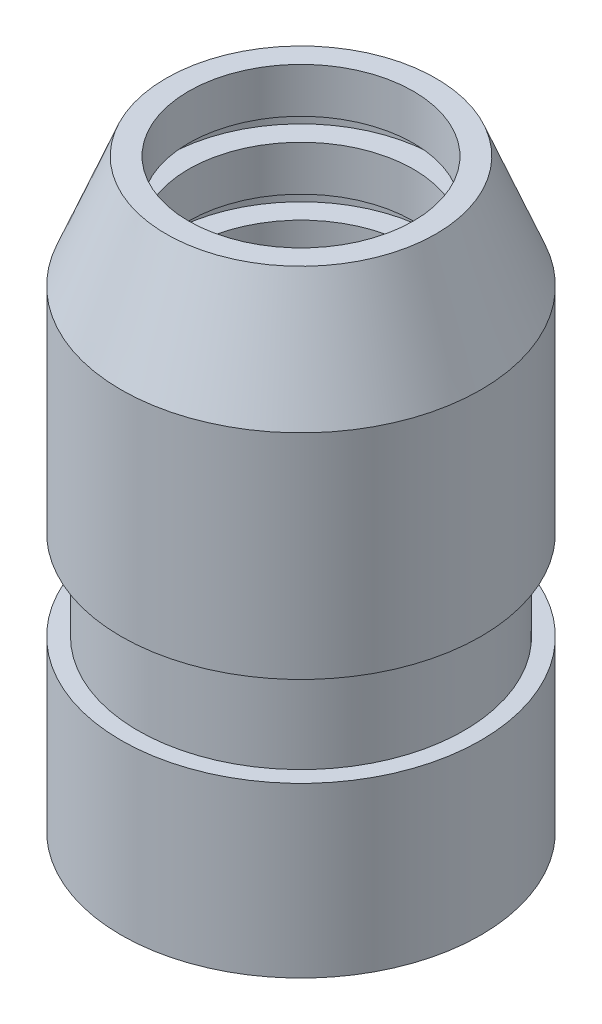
ISO-10303-21;
HEADER;
FILE_DESCRIPTION(('STEP AP214'),'2;1');
FILE_NAME('part.step','',(''),(''),'','','');
FILE_SCHEMA(('AUTOMOTIVE_DESIGN { 1 0 10303 214 1 1 1 1 }'));
ENDSEC;
DATA;
#1=APPLICATION_CONTEXT('core data for automotive mechanical design processes');
#2=APPLICATION_PROTOCOL_DEFINITION('international standard','automotive_design',2000,#1);
#3=PRODUCT_CONTEXT('',#1,'mechanical');
#4=PRODUCT('Part','Part','',(#3));
#5=PRODUCT_RELATED_PRODUCT_CATEGORY('part','',(#4));
#6=PRODUCT_DEFINITION_FORMATION('','',#4);
#7=PRODUCT_DEFINITION_CONTEXT('part definition',#1,'design');
#8=PRODUCT_DEFINITION('design','',#6,#7);
#9=PRODUCT_DEFINITION_SHAPE('','',#8);
#10=(LENGTH_UNIT() NAMED_UNIT(*) SI_UNIT(.MILLI.,.METRE.));
#11=(NAMED_UNIT(*) PLANE_ANGLE_UNIT() SI_UNIT($,.RADIAN.));
#12=(NAMED_UNIT(*) SI_UNIT($,.STERADIAN.) SOLID_ANGLE_UNIT());
#13=UNCERTAINTY_MEASURE_WITH_UNIT(LENGTH_MEASURE(1.E-05),#10,'distance_accuracy_value','');
#14=(GEOMETRIC_REPRESENTATION_CONTEXT(3) GLOBAL_UNCERTAINTY_ASSIGNED_CONTEXT((#13)) GLOBAL_UNIT_ASSIGNED_CONTEXT((#10,
#11,#12)) REPRESENTATION_CONTEXT('',''));
#15=CARTESIAN_POINT('',(0.,0.,0.));
#16=DIRECTION('',(0.,0.,1.));
#17=DIRECTION('',(1.,0.,0.));
#18=AXIS2_PLACEMENT_3D('',#15,#16,#17);
#19=CARTESIAN_POINT('',(7.50000000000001,0.,0.));
#20=DIRECTION('',(0.,1.,0.));
#21=DIRECTION('',(-1.,0.,0.));
#22=AXIS2_PLACEMENT_3D('',#19,#20,#21);
#23=PLANE('',#22);
#24=CARTESIAN_POINT('',(0.,0.,0.));
#25=DIRECTION('',(0.,1.,0.));
#26=DIRECTION('',(-1.,0.,0.));
#27=AXIS2_PLACEMENT_3D('',#24,#25,#26);
#28=CIRCLE('',#27,7.5);
#29=CARTESIAN_POINT('',(-7.5,0.,0.));
#30=VERTEX_POINT('',#29);
#31=EDGE_CURVE('E10',#30,#30,#28,.T.);
#32=ORIENTED_EDGE('',*,*,#31,.F.);
#33=EDGE_LOOP('',(#32));
#34=FACE_BOUND('',#33,.T.);
#35=CARTESIAN_POINT('',(0.,0.,0.));
#36=DIRECTION('',(0.,1.,0.));
#37=DIRECTION('',(-1.,0.,0.));
#38=AXIS2_PLACEMENT_3D('',#35,#36,#37);
#39=CIRCLE('',#38,6.5);
#40=CARTESIAN_POINT('',(-6.49999999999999,0.,0.));
#41=VERTEX_POINT('',#40);
#42=EDGE_CURVE('E98',#41,#41,#39,.T.);
#43=ORIENTED_EDGE('',*,*,#42,.T.);
#44=EDGE_LOOP('',(#43));
#45=FACE_BOUND('',#44,.T.);
#46=ADVANCED_FACE('F31',(#34,#45),#23,.F.);
#47=CARTESIAN_POINT('',(0.,37.7237460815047,0.));
#48=DIRECTION('',(0.,1.,0.));
#49=DIRECTION('',(-1.,0.,0.));
#50=AXIS2_PLACEMENT_3D('',#47,#48,#49);
#51=CYLINDRICAL_SURFACE('',#50,7.5);
#52=CARTESIAN_POINT('',(0.,-4.,0.));
#53=DIRECTION('',(0.,1.,0.));
#54=DIRECTION('',(-1.,0.,0.));
#55=AXIS2_PLACEMENT_3D('',#52,#53,#54);
#56=CIRCLE('',#55,7.5);
#57=CARTESIAN_POINT('',(-7.49999999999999,-4.,0.));
#58=VERTEX_POINT('',#57);
#59=EDGE_CURVE('E37',#58,#58,#56,.T.);
#60=ORIENTED_EDGE('',*,*,#59,.F.);
#61=EDGE_LOOP('',(#60));
#62=FACE_BOUND('',#61,.T.);
#63=ORIENTED_EDGE('',*,*,#31,.T.);
#64=EDGE_LOOP('',(#63));
#65=FACE_BOUND('',#64,.T.);
#66=ADVANCED_FACE('F213',(#62,#65),#51,.F.);
#67=CARTESIAN_POINT('',(8.,-4.,0.));
#68=DIRECTION('',(0.,1.,0.));
#69=DIRECTION('',(-1.,0.,0.));
#70=AXIS2_PLACEMENT_3D('',#67,#68,#69);
#71=PLANE('',#70);
#72=CARTESIAN_POINT('',(0.,-4.,0.));
#73=DIRECTION('',(0.,1.,0.));
#74=DIRECTION('',(-1.,0.,0.));
#75=AXIS2_PLACEMENT_3D('',#72,#73,#74);
#76=CIRCLE('',#75,8.);
#77=CARTESIAN_POINT('',(-7.99999999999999,-4.,0.));
#78=VERTEX_POINT('',#77);
#79=EDGE_CURVE('E41',#78,#78,#76,.T.);
#80=ORIENTED_EDGE('',*,*,#79,.F.);
#81=EDGE_LOOP('',(#80));
#82=FACE_BOUND('',#81,.T.);
#83=ORIENTED_EDGE('',*,*,#59,.T.);
#84=EDGE_LOOP('',(#83));
#85=FACE_BOUND('',#84,.T.);
#86=ADVANCED_FACE('F208',(#82,#85),#71,.F.);
#87=CARTESIAN_POINT('',(0.,37.7237460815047,0.));
#88=DIRECTION('',(0.,1.,0.));
#89=DIRECTION('',(-1.,0.,0.));
#90=AXIS2_PLACEMENT_3D('',#87,#88,#89);
#91=CYLINDRICAL_SURFACE('',#90,8.);
#92=CARTESIAN_POINT('',(0.,3.5,0.));
#93=DIRECTION('',(0.,1.,0.));
#94=DIRECTION('',(-1.,0.,0.));
#95=AXIS2_PLACEMENT_3D('',#92,#93,#94);
#96=CIRCLE('',#95,8.);
#97=CARTESIAN_POINT('',(-7.99999999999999,3.5,0.));
#98=VERTEX_POINT('',#97);
#99=EDGE_CURVE('E45',#98,#98,#96,.T.);
#100=ORIENTED_EDGE('',*,*,#99,.F.);
#101=EDGE_LOOP('',(#100));
#102=FACE_BOUND('',#101,.T.);
#103=ORIENTED_EDGE('',*,*,#79,.T.);
#104=EDGE_LOOP('',(#103));
#105=FACE_BOUND('',#104,.T.);
#106=ADVANCED_FACE('F202',(#102,#105),#91,.T.);
#107=CARTESIAN_POINT('',(7.25,3.5,0.));
#108=DIRECTION('',(0.,-1.,0.));
#109=DIRECTION('',(1.,0.,0.));
#110=AXIS2_PLACEMENT_3D('',#107,#108,#109);
#111=PLANE('',#110);
#112=CARTESIAN_POINT('',(0.,3.5,0.));
#113=DIRECTION('',(0.,1.,0.));
#114=DIRECTION('',(-1.,0.,0.));
#115=AXIS2_PLACEMENT_3D('',#112,#113,#114);
#116=CIRCLE('',#115,7.25);
#117=CARTESIAN_POINT('',(-7.24999999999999,3.5,0.));
#118=VERTEX_POINT('',#117);
#119=EDGE_CURVE('E50',#118,#118,#116,.T.);
#120=ORIENTED_EDGE('',*,*,#119,.F.);
#121=EDGE_LOOP('',(#120));
#122=FACE_BOUND('',#121,.T.);
#123=ORIENTED_EDGE('',*,*,#99,.T.);
#124=EDGE_LOOP('',(#123));
#125=FACE_BOUND('',#124,.T.);
#126=ADVANCED_FACE('F196',(#122,#125),#111,.F.);
#127=CARTESIAN_POINT('',(0.,37.7237460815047,0.));
#128=DIRECTION('',(0.,1.,0.));
#129=DIRECTION('',(-1.,0.,0.));
#130=AXIS2_PLACEMENT_3D('',#127,#128,#129);
#131=CYLINDRICAL_SURFACE('',#130,7.25);
#132=CARTESIAN_POINT('',(0.,7.5,0.));
#133=DIRECTION('',(0.,1.,0.));
#134=DIRECTION('',(-1.,0.,0.));
#135=AXIS2_PLACEMENT_3D('',#132,#133,#134);
#136=CIRCLE('',#135,7.25);
#137=CARTESIAN_POINT('',(-7.24999999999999,7.5,0.));
#138=VERTEX_POINT('',#137);
#139=EDGE_CURVE('E53',#138,#138,#136,.T.);
#140=ORIENTED_EDGE('',*,*,#139,.F.);
#141=EDGE_LOOP('',(#140));
#142=FACE_BOUND('',#141,.T.);
#143=ORIENTED_EDGE('',*,*,#119,.T.);
#144=EDGE_LOOP('',(#143));
#145=FACE_BOUND('',#144,.T.);
#146=ADVANCED_FACE('F190',(#142,#145),#131,.T.);
#147=CARTESIAN_POINT('',(8.,7.5,0.));
#148=DIRECTION('',(0.,1.,0.));
#149=DIRECTION('',(-1.,0.,0.));
#150=AXIS2_PLACEMENT_3D('',#147,#148,#149);
#151=PLANE('',#150);
#152=CARTESIAN_POINT('',(0.,7.5,0.));
#153=DIRECTION('',(0.,1.,0.));
#154=DIRECTION('',(-1.,0.,0.));
#155=AXIS2_PLACEMENT_3D('',#152,#153,#154);
#156=CIRCLE('',#155,8.);
#157=CARTESIAN_POINT('',(-7.99999999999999,7.5,0.));
#158=VERTEX_POINT('',#157);
#159=EDGE_CURVE('E56',#158,#158,#156,.T.);
#160=ORIENTED_EDGE('',*,*,#159,.F.);
#161=EDGE_LOOP('',(#160));
#162=FACE_BOUND('',#161,.T.);
#163=ORIENTED_EDGE('',*,*,#139,.T.);
#164=EDGE_LOOP('',(#163));
#165=FACE_BOUND('',#164,.T.);
#166=ADVANCED_FACE('F184',(#162,#165),#151,.F.);
#167=CARTESIAN_POINT('',(0.,37.7237460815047,0.));
#168=DIRECTION('',(0.,1.,0.));
#169=DIRECTION('',(-1.,0.,0.));
#170=AXIS2_PLACEMENT_3D('',#167,#168,#169);
#171=CYLINDRICAL_SURFACE('',#170,8.);
#172=CARTESIAN_POINT('',(0.,17.,0.));
#173=DIRECTION('',(0.,1.,0.));
#174=DIRECTION('',(-1.,0.,0.));
#175=AXIS2_PLACEMENT_3D('',#172,#173,#174);
#176=CIRCLE('',#175,8.);
#177=CARTESIAN_POINT('',(-8.,17.,0.));
#178=VERTEX_POINT('',#177);
#179=EDGE_CURVE('E59',#178,#178,#176,.T.);
#180=ORIENTED_EDGE('',*,*,#179,.F.);
#181=EDGE_LOOP('',(#180));
#182=FACE_BOUND('',#181,.T.);
#183=ORIENTED_EDGE('',*,*,#159,.T.);
#184=EDGE_LOOP('',(#183));
#185=FACE_BOUND('',#184,.T.);
#186=ADVANCED_FACE('F178',(#182,#185),#171,.T.);
#187=CARTESIAN_POINT('',(0.,17.,0.));
#188=DIRECTION('',(0.,-1.,0.));
#189=DIRECTION('',(1.,0.,0.));
#190=AXIS2_PLACEMENT_3D('',#187,#188,#189);
#191=CONICAL_SURFACE('',#190,8.,0.380506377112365);
#192=CARTESIAN_POINT('',(0.,22.,0.));
#193=DIRECTION('',(0.,1.,0.));
#194=DIRECTION('',(-1.,0.,0.));
#195=AXIS2_PLACEMENT_3D('',#192,#193,#194);
#196=CIRCLE('',#195,6.);
#197=CARTESIAN_POINT('',(-6.,22.,0.));
#198=VERTEX_POINT('',#197);
#199=EDGE_CURVE('E62',#198,#198,#196,.T.);
#200=ORIENTED_EDGE('',*,*,#199,.F.);
#201=EDGE_LOOP('',(#200));
#202=FACE_BOUND('',#201,.T.);
#203=ORIENTED_EDGE('',*,*,#179,.T.);
#204=EDGE_LOOP('',(#203));
#205=FACE_BOUND('',#204,.T.);
#206=ADVANCED_FACE('F172',(#202,#205),#191,.T.);
#207=CARTESIAN_POINT('',(5.,22.,0.));
#208=DIRECTION('',(0.,-1.,0.));
#209=DIRECTION('',(1.,0.,0.));
#210=AXIS2_PLACEMENT_3D('',#207,#208,#209);
#211=PLANE('',#210);
#212=CARTESIAN_POINT('',(0.,22.,0.));
#213=DIRECTION('',(0.,1.,0.));
#214=DIRECTION('',(-1.,0.,0.));
#215=AXIS2_PLACEMENT_3D('',#212,#213,#214);
#216=CIRCLE('',#215,5.);
#217=CARTESIAN_POINT('',(-5.,22.,0.));
#218=VERTEX_POINT('',#217);
#219=EDGE_CURVE('E65',#218,#218,#216,.T.);
#220=ORIENTED_EDGE('',*,*,#219,.F.);
#221=EDGE_LOOP('',(#220));
#222=FACE_BOUND('',#221,.T.);
#223=ORIENTED_EDGE('',*,*,#199,.T.);
#224=EDGE_LOOP('',(#223));
#225=FACE_BOUND('',#224,.T.);
#226=ADVANCED_FACE('F166',(#222,#225),#211,.F.);
#227=CARTESIAN_POINT('',(0.,37.7237460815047,0.));
#228=DIRECTION('',(0.,1.,0.));
#229=DIRECTION('',(-1.,0.,0.));
#230=AXIS2_PLACEMENT_3D('',#227,#228,#229);
#231=CYLINDRICAL_SURFACE('',#230,5.);
#232=CARTESIAN_POINT('',(0.,20.,0.));
#233=DIRECTION('',(0.,1.,0.));
#234=DIRECTION('',(-1.,0.,0.));
#235=AXIS2_PLACEMENT_3D('',#232,#233,#234);
#236=CIRCLE('',#235,5.);
#237=CARTESIAN_POINT('',(-5.,20.,0.));
#238=VERTEX_POINT('',#237);
#239=EDGE_CURVE('E68',#238,#238,#236,.T.);
#240=ORIENTED_EDGE('',*,*,#239,.F.);
#241=EDGE_LOOP('',(#240));
#242=FACE_BOUND('',#241,.T.);
#243=ORIENTED_EDGE('',*,*,#219,.T.);
#244=EDGE_LOOP('',(#243));
#245=FACE_BOUND('',#244,.T.);
#246=ADVANCED_FACE('F160',(#242,#245),#231,.F.);
#247=CARTESIAN_POINT('',(6.,20.,0.));
#248=DIRECTION('',(0.,1.,0.));
#249=DIRECTION('',(-1.,0.,0.));
#250=AXIS2_PLACEMENT_3D('',#247,#248,#249);
#251=PLANE('',#250);
#252=CARTESIAN_POINT('',(0.,20.,0.));
#253=DIRECTION('',(0.,1.,0.));
#254=DIRECTION('',(-1.,0.,0.));
#255=AXIS2_PLACEMENT_3D('',#252,#253,#254);
#256=CIRCLE('',#255,6.);
#257=CARTESIAN_POINT('',(-6.,20.,0.));
#258=VERTEX_POINT('',#257);
#259=EDGE_CURVE('E71',#258,#258,#256,.T.);
#260=ORIENTED_EDGE('',*,*,#259,.F.);
#261=EDGE_LOOP('',(#260));
#262=FACE_BOUND('',#261,.T.);
#263=ORIENTED_EDGE('',*,*,#239,.T.);
#264=EDGE_LOOP('',(#263));
#265=FACE_BOUND('',#264,.T.);
#266=ADVANCED_FACE('F154',(#262,#265),#251,.F.);
#267=CARTESIAN_POINT('',(0.,37.7237460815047,0.));
#268=DIRECTION('',(0.,1.,0.));
#269=DIRECTION('',(-1.,0.,0.));
#270=AXIS2_PLACEMENT_3D('',#267,#268,#269);
#271=CYLINDRICAL_SURFACE('',#270,6.);
#272=CARTESIAN_POINT('',(0.,19.,0.));
#273=DIRECTION('',(0.,1.,0.));
#274=DIRECTION('',(-1.,0.,0.));
#275=AXIS2_PLACEMENT_3D('',#272,#273,#274);
#276=CIRCLE('',#275,6.);
#277=CARTESIAN_POINT('',(-6.,19.,0.));
#278=VERTEX_POINT('',#277);
#279=EDGE_CURVE('E74',#278,#278,#276,.T.);
#280=ORIENTED_EDGE('',*,*,#279,.F.);
#281=EDGE_LOOP('',(#280));
#282=FACE_BOUND('',#281,.T.);
#283=ORIENTED_EDGE('',*,*,#259,.T.);
#284=EDGE_LOOP('',(#283));
#285=FACE_BOUND('',#284,.T.);
#286=ADVANCED_FACE('F148',(#282,#285),#271,.F.);
#287=CARTESIAN_POINT('',(5.,19.,0.));
#288=DIRECTION('',(0.,-1.,0.));
#289=DIRECTION('',(1.,0.,0.));
#290=AXIS2_PLACEMENT_3D('',#287,#288,#289);
#291=PLANE('',#290);
#292=CARTESIAN_POINT('',(0.,19.,0.));
#293=DIRECTION('',(0.,1.,0.));
#294=DIRECTION('',(-1.,0.,0.));
#295=AXIS2_PLACEMENT_3D('',#292,#293,#294);
#296=CIRCLE('',#295,5.);
#297=CARTESIAN_POINT('',(-5.,19.,0.));
#298=VERTEX_POINT('',#297);
#299=EDGE_CURVE('E77',#298,#298,#296,.T.);
#300=ORIENTED_EDGE('',*,*,#299,.F.);
#301=EDGE_LOOP('',(#300));
#302=FACE_BOUND('',#301,.T.);
#303=ORIENTED_EDGE('',*,*,#279,.T.);
#304=EDGE_LOOP('',(#303));
#305=FACE_BOUND('',#304,.T.);
#306=ADVANCED_FACE('F142',(#302,#305),#291,.F.);
#307=CARTESIAN_POINT('',(0.,37.7237460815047,0.));
#308=DIRECTION('',(0.,1.,0.));
#309=DIRECTION('',(-1.,0.,0.));
#310=AXIS2_PLACEMENT_3D('',#307,#308,#309);
#311=CYLINDRICAL_SURFACE('',#310,5.);
#312=CARTESIAN_POINT('',(0.,17.,0.));
#313=DIRECTION('',(0.,1.,0.));
#314=DIRECTION('',(-1.,0.,0.));
#315=AXIS2_PLACEMENT_3D('',#312,#313,#314);
#316=CIRCLE('',#315,5.);
#317=CARTESIAN_POINT('',(-5.,17.,0.));
#318=VERTEX_POINT('',#317);
#319=EDGE_CURVE('E80',#318,#318,#316,.T.);
#320=ORIENTED_EDGE('',*,*,#319,.F.);
#321=EDGE_LOOP('',(#320));
#322=FACE_BOUND('',#321,.T.);
#323=ORIENTED_EDGE('',*,*,#299,.T.);
#324=EDGE_LOOP('',(#323));
#325=FACE_BOUND('',#324,.T.);
#326=ADVANCED_FACE('F136',(#322,#325),#311,.F.);
#327=CARTESIAN_POINT('',(6.,17.,0.));
#328=DIRECTION('',(0.,1.,0.));
#329=DIRECTION('',(-1.,0.,0.));
#330=AXIS2_PLACEMENT_3D('',#327,#328,#329);
#331=PLANE('',#330);
#332=CARTESIAN_POINT('',(0.,17.,0.));
#333=DIRECTION('',(0.,1.,0.));
#334=DIRECTION('',(-1.,0.,0.));
#335=AXIS2_PLACEMENT_3D('',#332,#333,#334);
#336=CIRCLE('',#335,6.);
#337=CARTESIAN_POINT('',(-6.,17.,0.));
#338=VERTEX_POINT('',#337);
#339=EDGE_CURVE('E83',#338,#338,#336,.T.);
#340=ORIENTED_EDGE('',*,*,#339,.F.);
#341=EDGE_LOOP('',(#340));
#342=FACE_BOUND('',#341,.T.);
#343=ORIENTED_EDGE('',*,*,#319,.T.);
#344=EDGE_LOOP('',(#343));
#345=FACE_BOUND('',#344,.T.);
#346=ADVANCED_FACE('F130',(#342,#345),#331,.F.);
#347=CARTESIAN_POINT('',(0.,37.7237460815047,0.));
#348=DIRECTION('',(0.,1.,0.));
#349=DIRECTION('',(-1.,0.,0.));
#350=AXIS2_PLACEMENT_3D('',#347,#348,#349);
#351=CYLINDRICAL_SURFACE('',#350,6.);
#352=CARTESIAN_POINT('',(0.,16.,0.));
#353=DIRECTION('',(0.,1.,0.));
#354=DIRECTION('',(-1.,0.,0.));
#355=AXIS2_PLACEMENT_3D('',#352,#353,#354);
#356=CIRCLE('',#355,6.);
#357=CARTESIAN_POINT('',(-6.,16.,0.));
#358=VERTEX_POINT('',#357);
#359=EDGE_CURVE('E86',#358,#358,#356,.T.);
#360=ORIENTED_EDGE('',*,*,#359,.F.);
#361=EDGE_LOOP('',(#360));
#362=FACE_BOUND('',#361,.T.);
#363=ORIENTED_EDGE('',*,*,#339,.T.);
#364=EDGE_LOOP('',(#363));
#365=FACE_BOUND('',#364,.T.);
#366=ADVANCED_FACE('F124',(#362,#365),#351,.F.);
#367=CARTESIAN_POINT('',(5.,16.,0.));
#368=DIRECTION('',(0.,-1.,0.));
#369=DIRECTION('',(1.,0.,0.));
#370=AXIS2_PLACEMENT_3D('',#367,#368,#369);
#371=PLANE('',#370);
#372=CARTESIAN_POINT('',(0.,16.,0.));
#373=DIRECTION('',(0.,1.,0.));
#374=DIRECTION('',(-1.,0.,0.));
#375=AXIS2_PLACEMENT_3D('',#372,#373,#374);
#376=CIRCLE('',#375,5.);
#377=CARTESIAN_POINT('',(-5.,16.,0.));
#378=VERTEX_POINT('',#377);
#379=EDGE_CURVE('E89',#378,#378,#376,.T.);
#380=ORIENTED_EDGE('',*,*,#379,.F.);
#381=EDGE_LOOP('',(#380));
#382=FACE_BOUND('',#381,.T.);
#383=ORIENTED_EDGE('',*,*,#359,.T.);
#384=EDGE_LOOP('',(#383));
#385=FACE_BOUND('',#384,.T.);
#386=ADVANCED_FACE('F118',(#382,#385),#371,.F.);
#387=CARTESIAN_POINT('',(0.,37.7237460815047,0.));
#388=DIRECTION('',(0.,1.,0.));
#389=DIRECTION('',(-1.,0.,0.));
#390=AXIS2_PLACEMENT_3D('',#387,#388,#389);
#391=CYLINDRICAL_SURFACE('',#390,5.);
#392=CARTESIAN_POINT('',(0.,4.5,0.));
#393=DIRECTION('',(0.,1.,0.));
#394=DIRECTION('',(-1.,0.,0.));
#395=AXIS2_PLACEMENT_3D('',#392,#393,#394);
#396=CIRCLE('',#395,5.);
#397=CARTESIAN_POINT('',(-4.99999999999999,4.5,0.));
#398=VERTEX_POINT('',#397);
#399=EDGE_CURVE('E92',#398,#398,#396,.T.);
#400=ORIENTED_EDGE('',*,*,#399,.F.);
#401=EDGE_LOOP('',(#400));
#402=FACE_BOUND('',#401,.T.);
#403=ORIENTED_EDGE('',*,*,#379,.T.);
#404=EDGE_LOOP('',(#403));
#405=FACE_BOUND('',#404,.T.);
#406=ADVANCED_FACE('F112',(#402,#405),#391,.F.);
#407=CARTESIAN_POINT('',(6.50000000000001,4.5,0.));
#408=DIRECTION('',(0.,1.,0.));
#409=DIRECTION('',(-1.,0.,0.));
#410=AXIS2_PLACEMENT_3D('',#407,#408,#409);
#411=PLANE('',#410);
#412=CARTESIAN_POINT('',(0.,4.5,0.));
#413=DIRECTION('',(0.,1.,0.));
#414=DIRECTION('',(-1.,0.,0.));
#415=AXIS2_PLACEMENT_3D('',#412,#413,#414);
#416=CIRCLE('',#415,6.5);
#417=CARTESIAN_POINT('',(-6.49999999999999,4.5,0.));
#418=VERTEX_POINT('',#417);
#419=EDGE_CURVE('E95',#418,#418,#416,.T.);
#420=ORIENTED_EDGE('',*,*,#419,.F.);
#421=EDGE_LOOP('',(#420));
#422=FACE_BOUND('',#421,.T.);
#423=ORIENTED_EDGE('',*,*,#399,.T.);
#424=EDGE_LOOP('',(#423));
#425=FACE_BOUND('',#424,.T.);
#426=ADVANCED_FACE('F106',(#422,#425),#411,.F.);
#427=CARTESIAN_POINT('',(0.,37.7237460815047,0.));
#428=DIRECTION('',(0.,1.,0.));
#429=DIRECTION('',(-1.,0.,0.));
#430=AXIS2_PLACEMENT_3D('',#427,#428,#429);
#431=CYLINDRICAL_SURFACE('',#430,6.5);
#432=ORIENTED_EDGE('',*,*,#42,.F.);
#433=EDGE_LOOP('',(#432));
#434=FACE_BOUND('',#433,.T.);
#435=ORIENTED_EDGE('',*,*,#419,.T.);
#436=EDGE_LOOP('',(#435));
#437=FACE_BOUND('',#436,.T.);
#438=ADVANCED_FACE('F103',(#434,#437),#431,.F.);
#439=CLOSED_SHELL('',(#46,#66,#86,#106,#126,#146,#166,#186,#206,#226,#246,#266,#286,#306,#326,
#346,#366,#386,#406,#426,#438));
#440=MANIFOLD_SOLID_BREP('B2',#439);
#441=ADVANCED_BREP_SHAPE_REPRESENTATION('',(#18,#440),#14);
#442=SHAPE_DEFINITION_REPRESENTATION(#9,#441);
ENDSEC;
END-ISO-10303-21;
